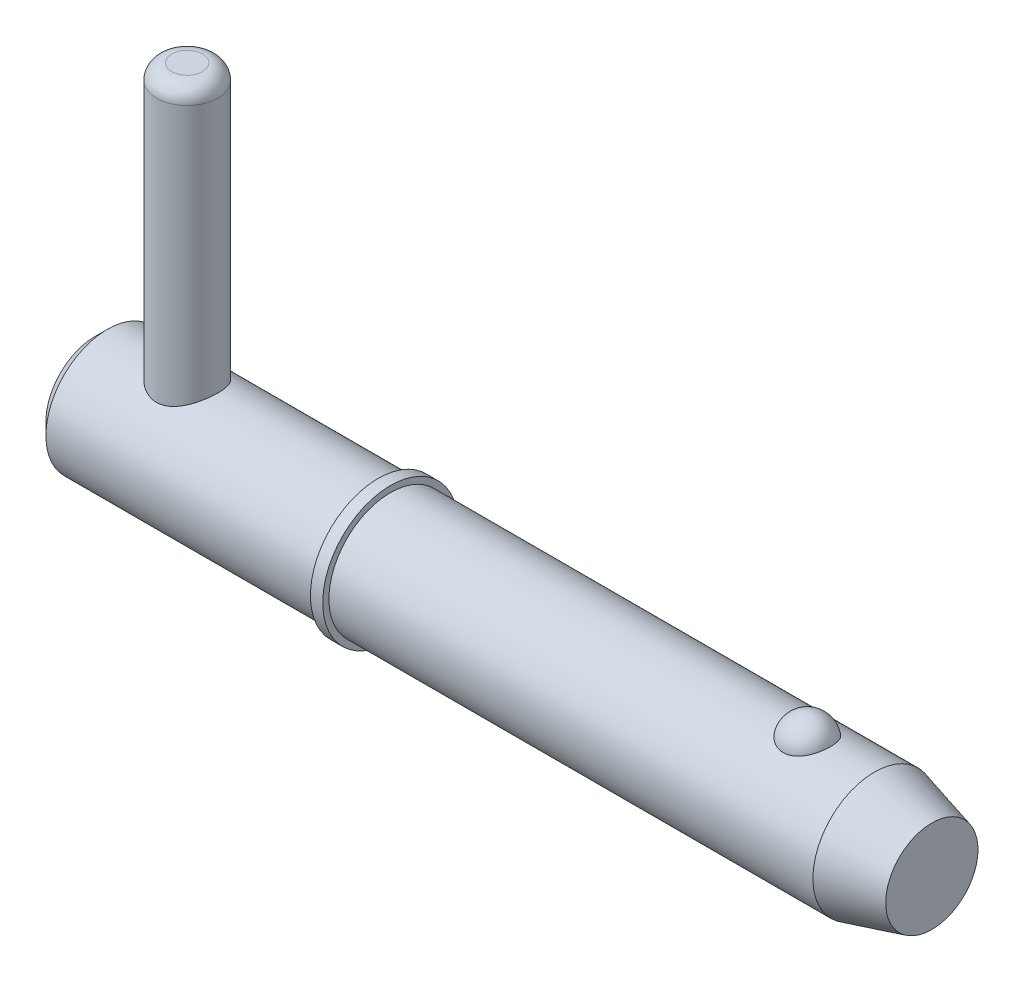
ISO-10303-21;
HEADER;
FILE_DESCRIPTION(('STEP AP214'),'2;1');
FILE_NAME('part.step','',(''),(''),'','','');
FILE_SCHEMA(('AUTOMOTIVE_DESIGN { 1 0 10303 214 1 1 1 1 }'));
ENDSEC;
DATA;
#1=APPLICATION_CONTEXT('core data for automotive mechanical design processes');
#2=APPLICATION_PROTOCOL_DEFINITION('international standard','automotive_design',2000,#1);
#3=PRODUCT_CONTEXT('',#1,'mechanical');
#4=PRODUCT('Part','Part','',(#3));
#5=PRODUCT_RELATED_PRODUCT_CATEGORY('part','',(#4));
#6=PRODUCT_DEFINITION_FORMATION('','',#4);
#7=PRODUCT_DEFINITION_CONTEXT('part definition',#1,'design');
#8=PRODUCT_DEFINITION('design','',#6,#7);
#9=PRODUCT_DEFINITION_SHAPE('','',#8);
#10=(LENGTH_UNIT() NAMED_UNIT(*) SI_UNIT(.MILLI.,.METRE.));
#11=(NAMED_UNIT(*) PLANE_ANGLE_UNIT() SI_UNIT($,.RADIAN.));
#12=(NAMED_UNIT(*) SI_UNIT($,.STERADIAN.) SOLID_ANGLE_UNIT());
#13=UNCERTAINTY_MEASURE_WITH_UNIT(LENGTH_MEASURE(1.E-05),#10,'distance_accuracy_value','');
#14=(GEOMETRIC_REPRESENTATION_CONTEXT(3) GLOBAL_UNCERTAINTY_ASSIGNED_CONTEXT((#13)) GLOBAL_UNIT_ASSIGNED_CONTEXT((#10,
#11,#12)) REPRESENTATION_CONTEXT('',''));
#15=CARTESIAN_POINT('',(0.,0.,0.));
#16=DIRECTION('',(0.,0.,1.));
#17=DIRECTION('',(1.,0.,0.));
#18=AXIS2_PLACEMENT_3D('',#15,#16,#17);
#19=CARTESIAN_POINT('',(5.94,21.43,0.));
#20=DIRECTION('',(0.,-1.,0.));
#21=DIRECTION('',(0.,0.,-1.));
#22=AXIS2_PLACEMENT_3D('',#19,#20,#21);
#23=CYLINDRICAL_SURFACE('',#22,1.98);
#24=CARTESIAN_POINT('',(5.94,-2.98,0.));
#25=DIRECTION('',(0.,1.,0.));
#26=DIRECTION('',(0.,0.,1.));
#27=AXIS2_PLACEMENT_3D('',#24,#25,#26);
#28=CIRCLE('',#27,1.98);
#29=CARTESIAN_POINT('',(5.94,-2.98,1.98));
#30=VERTEX_POINT('',#29);
#31=EDGE_CURVE('P0_E25',#30,#30,#28,.T.);
#32=ORIENTED_EDGE('',*,*,#31,.T.);
#33=EDGE_LOOP('',(#32));
#34=FACE_BOUND('',#33,.T.);
#35=CARTESIAN_POINT('',(5.94,20.44,0.));
#36=DIRECTION('',(0.,1.,0.));
#37=DIRECTION('',(0.,0.,1.));
#38=AXIS2_PLACEMENT_3D('',#35,#36,#37);
#39=CIRCLE('',#38,1.98);
#40=CARTESIAN_POINT('',(5.94,20.44,1.98));
#41=VERTEX_POINT('',#40);
#42=EDGE_CURVE('P0_E29',#41,#41,#39,.F.);
#43=ORIENTED_EDGE('',*,*,#42,.T.);
#44=EDGE_LOOP('',(#43));
#45=FACE_BOUND('',#44,.T.);
#46=ADVANCED_FACE('P0_F14',(#34,#45),#23,.T.);
#47=CARTESIAN_POINT('',(5.94,21.43,0.));
#48=DIRECTION('',(0.,1.,0.));
#49=DIRECTION('',(0.,0.,1.));
#50=AXIS2_PLACEMENT_3D('',#47,#48,#49);
#51=PLANE('',#50);
#52=CARTESIAN_POINT('',(5.94,21.43,0.));
#53=DIRECTION('',(0.,1.,0.));
#54=DIRECTION('',(0.,0.,1.));
#55=AXIS2_PLACEMENT_3D('',#52,#53,#54);
#56=CIRCLE('',#55,0.99);
#57=CARTESIAN_POINT('',(5.94,21.43,0.99));
#58=VERTEX_POINT('',#57);
#59=EDGE_CURVE('P0_E10',#58,#58,#56,.T.);
#60=ORIENTED_EDGE('',*,*,#59,.T.);
#61=EDGE_LOOP('',(#60));
#62=FACE_BOUND('',#61,.T.);
#63=ADVANCED_FACE('P0_F46',(#62),#51,.T.);
#64=CARTESIAN_POINT('',(5.94,-3.97,0.));
#65=DIRECTION('',(0.,1.,0.));
#66=DIRECTION('',(0.,0.,1.));
#67=AXIS2_PLACEMENT_3D('',#64,#65,#66);
#68=PLANE('',#67);
#69=CARTESIAN_POINT('',(5.94,-3.97,0.));
#70=DIRECTION('',(0.,1.,0.));
#71=DIRECTION('',(0.,0.,1.));
#72=AXIS2_PLACEMENT_3D('',#69,#70,#71);
#73=CIRCLE('',#72,0.99);
#74=CARTESIAN_POINT('',(5.94,-3.97,0.99));
#75=VERTEX_POINT('',#74);
#76=EDGE_CURVE('P0_E21',#75,#75,#73,.F.);
#77=ORIENTED_EDGE('',*,*,#76,.T.);
#78=EDGE_LOOP('',(#77));
#79=FACE_BOUND('',#78,.T.);
#80=ADVANCED_FACE('P0_F43',(#79),#68,.F.);
#81=CARTESIAN_POINT('',(5.94,-2.98,0.));
#82=DIRECTION('',(0.,1.,0.));
#83=DIRECTION('',(0.,0.,1.));
#84=AXIS2_PLACEMENT_3D('',#81,#82,#83);
#85=DEGENERATE_TOROIDAL_SURFACE('',#84,0.99,0.99,.T.);
#86=ORIENTED_EDGE('',*,*,#76,.F.);
#87=EDGE_LOOP('',(#86));
#88=FACE_BOUND('',#87,.T.);
#89=ORIENTED_EDGE('',*,*,#31,.F.);
#90=EDGE_LOOP('',(#89));
#91=FACE_BOUND('',#90,.T.);
#92=ADVANCED_FACE('P0_F38',(#88,#91),#85,.T.);
#93=CARTESIAN_POINT('',(5.94,20.44,0.));
#94=DIRECTION('',(0.,1.,0.));
#95=DIRECTION('',(0.,0.,1.));
#96=AXIS2_PLACEMENT_3D('',#93,#94,#95);
#97=DEGENERATE_TOROIDAL_SURFACE('',#96,0.99,0.99,.T.);
#98=ORIENTED_EDGE('',*,*,#42,.F.);
#99=EDGE_LOOP('',(#98));
#100=FACE_BOUND('',#99,.T.);
#101=ORIENTED_EDGE('',*,*,#59,.F.);
#102=EDGE_LOOP('',(#101));
#103=FACE_BOUND('',#102,.T.);
#104=ADVANCED_FACE('P0_F16',(#100,#103),#97,.T.);
#105=CLOSED_SHELL('',(#46,#63,#80,#92,#104));
#106=MANIFOLD_SOLID_BREP('P0_B1',#105);
#107=CARTESIAN_POINT('',(0.,0.,0.));
#108=DIRECTION('',(1.,0.,0.));
#109=DIRECTION('',(0.,0.,-1.));
#110=AXIS2_PLACEMENT_3D('',#107,#108,#109);
#111=CYLINDRICAL_SURFACE('',#110,3.97);
#112=CARTESIAN_POINT('',(50.2759395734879,0.,0.));
#113=DIRECTION('',(1.,0.,0.));
#114=DIRECTION('',(0.,0.,-1.));
#115=AXIS2_PLACEMENT_3D('',#112,#113,#114);
#116=CIRCLE('',#115,3.97);
#117=CARTESIAN_POINT('',(50.2759395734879,0.,-3.97));
#118=VERTEX_POINT('',#117);
#119=EDGE_CURVE('P1_E81',#118,#118,#116,.T.);
#120=ORIENTED_EDGE('',*,*,#119,.F.);
#121=EDGE_LOOP('',(#120));
#122=FACE_BOUND('',#121,.T.);
#123=CARTESIAN_POINT('',(19.05,0.,0.));
#124=DIRECTION('',(1.,0.,0.));
#125=DIRECTION('',(0.,0.,-1.));
#126=AXIS2_PLACEMENT_3D('',#123,#124,#125);
#127=CIRCLE('',#126,3.97);
#128=CARTESIAN_POINT('',(19.05,0.,-3.97));
#129=VERTEX_POINT('',#128);
#130=EDGE_CURVE('P1_E85',#129,#129,#127,.T.);
#131=ORIENTED_EDGE('',*,*,#130,.T.);
#132=EDGE_LOOP('',(#131));
#133=FACE_BOUND('',#132,.T.);
#134=CARTESIAN_POINT('',(45.9451922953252,3.65715365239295,1.54470941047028));
#135=CARTESIAN_POINT('',(45.8652448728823,3.65716001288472,1.54470290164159));
#136=CARTESIAN_POINT('',(45.7851650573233,3.65987074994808,1.53832549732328));
#137=CARTESIAN_POINT('',(45.6272374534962,3.6704221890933,1.51297018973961));
#138=CARTESIAN_POINT('',(45.5493961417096,3.67827646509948,1.49395894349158));
#139=CARTESIAN_POINT('',(45.3984614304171,3.69818848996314,1.44395950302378));
#140=CARTESIAN_POINT('',(45.3253560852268,3.71023513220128,1.41300293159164));
#141=CARTESIAN_POINT('',(45.1855630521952,3.7372183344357,1.34000212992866));
#142=CARTESIAN_POINT('',(45.1188725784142,3.75215363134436,1.29796274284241));
#143=CARTESIAN_POINT('',(44.9914886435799,3.78384968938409,1.20248834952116));
#144=CARTESIAN_POINT('',(44.9310299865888,3.80065129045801,1.14875388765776));
#145=CARTESIAN_POINT('',(44.8196942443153,3.83398532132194,1.03205417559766));
#146=CARTESIAN_POINT('',(44.7688200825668,3.85051766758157,0.969086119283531));
#147=CARTESIAN_POINT('',(44.6756321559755,3.88238608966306,0.832526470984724));
#148=CARTESIAN_POINT('',(44.6337961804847,3.89763698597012,0.758588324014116));
#149=CARTESIAN_POINT('',(44.5625108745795,3.92451063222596,0.604352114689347));
#150=CARTESIAN_POINT('',(44.5330623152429,3.93613315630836,0.524053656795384));
#151=CARTESIAN_POINT('',(44.4868927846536,3.95467606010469,0.358403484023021));
#152=CARTESIAN_POINT('',(44.4703127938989,3.96154426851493,0.273006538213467));
#153=CARTESIAN_POINT('',(44.450756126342,3.96967008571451,0.100408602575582));
#154=CARTESIAN_POINT('',(44.4477789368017,3.97092790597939,0.0132076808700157));
#155=CARTESIAN_POINT('',(44.4554587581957,3.96771794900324,-0.159844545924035));
#156=CARTESIAN_POINT('',(44.4660164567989,3.96329187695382,-0.245701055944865));
#157=CARTESIAN_POINT('',(44.5003800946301,3.94923163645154,-0.414277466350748));
#158=CARTESIAN_POINT('',(44.5241862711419,3.93959737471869,-0.496997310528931));
#159=CARTESIAN_POINT('',(44.5846114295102,3.91607752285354,-0.657113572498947));
#160=CARTESIAN_POINT('',(44.6212495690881,3.90218558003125,-0.734501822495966));
#161=CARTESIAN_POINT('',(44.7065935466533,3.87158287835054,-0.881704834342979));
#162=CARTESIAN_POINT('',(44.7553004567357,3.8548718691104,-0.951518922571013));
#163=CARTESIAN_POINT('',(44.8641161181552,3.82028735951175,-1.08208159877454));
#164=CARTESIAN_POINT('',(44.9242955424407,3.80240713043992,-1.14276958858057));
#165=CARTESIAN_POINT('',(45.054493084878,3.76758161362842,-1.2528243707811));
#166=CARTESIAN_POINT('',(45.1245105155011,3.75063626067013,-1.30219195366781));
#167=CARTESIAN_POINT('',(45.27118160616,3.71998948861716,-1.38729709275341));
#168=CARTESIAN_POINT('',(45.3476813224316,3.70623183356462,-1.42327904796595));
#169=CARTESIAN_POINT('',(45.5062981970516,3.68323188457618,-1.48178996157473));
#170=CARTESIAN_POINT('',(45.5884132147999,3.67398788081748,-1.5043240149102));
#171=CARTESIAN_POINT('',(45.7514810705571,3.6615216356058,-1.53440939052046));
#172=CARTESIAN_POINT('',(45.8322840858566,3.65801951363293,-1.54265826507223));
#173=CARTESIAN_POINT('',(45.9942085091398,3.65657341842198,-1.5460842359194));
#174=CARTESIAN_POINT('',(46.0753298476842,3.65862829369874,-1.54126404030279));
#175=CARTESIAN_POINT('',(46.2328122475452,3.66788969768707,-1.51908474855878));
#176=CARTESIAN_POINT('',(46.3092422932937,3.67492621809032,-1.50213925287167));
#177=CARTESIAN_POINT('',(46.4580412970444,3.69318404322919,-1.45666982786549));
#178=CARTESIAN_POINT('',(46.5304099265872,3.70440568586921,-1.42814496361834));
#179=CARTESIAN_POINT('',(46.6708029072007,3.73012749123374,-1.35956319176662));
#180=CARTESIAN_POINT('',(46.7387000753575,3.74469307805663,-1.31927107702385));
#181=CARTESIAN_POINT('',(46.8668649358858,3.77545272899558,-1.22847440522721));
#182=CARTESIAN_POINT('',(46.9271308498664,3.79164717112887,-1.17796747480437));
#183=CARTESIAN_POINT('',(47.0416346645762,3.82490325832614,-1.06519260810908));
#184=CARTESIAN_POINT('',(47.0954137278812,3.84196735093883,-1.00245914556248));
#185=CARTESIAN_POINT('',(47.1920988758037,3.87439863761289,-0.868715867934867));
#186=CARTESIAN_POINT('',(47.2350030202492,3.88976552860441,-0.797704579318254));
#187=CARTESIAN_POINT('',(47.310266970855,3.91771381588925,-0.646896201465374));
#188=CARTESIAN_POINT('',(47.3422532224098,3.93019255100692,-0.566893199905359));
#189=CARTESIAN_POINT('',(47.3931101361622,3.95043886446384,-0.402255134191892));
#190=CARTESIAN_POINT('',(47.4119807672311,3.95820643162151,-0.317620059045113));
#191=CARTESIAN_POINT('',(47.4362162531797,3.96823733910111,-0.146156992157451));
#192=CARTESIAN_POINT('',(47.4415874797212,3.970503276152,-0.0593300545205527));
#193=CARTESIAN_POINT('',(47.4387309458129,3.96930811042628,0.114057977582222));
#194=CARTESIAN_POINT('',(47.430503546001,3.9658471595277,0.200619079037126));
#195=CARTESIAN_POINT('',(47.4007063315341,3.95358562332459,0.370506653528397));
#196=CARTESIAN_POINT('',(47.3792129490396,3.94481563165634,0.453848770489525));
#197=CARTESIAN_POINT('',(47.3233839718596,3.92284586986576,0.615497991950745));
#198=CARTESIAN_POINT('',(47.2890474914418,3.90964579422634,0.69380474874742));
#199=CARTESIAN_POINT('',(47.2079702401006,3.88006987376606,0.843703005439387));
#200=CARTESIAN_POINT('',(47.1611536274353,3.86367478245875,0.915249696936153));
#201=CARTESIAN_POINT('',(47.0561897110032,3.82949741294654,1.04910810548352));
#202=CARTESIAN_POINT('',(46.9980428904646,3.81171519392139,1.11142021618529));
#203=CARTESIAN_POINT('',(46.8717433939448,3.77673366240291,1.22503948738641));
#204=CARTESIAN_POINT('',(46.8035970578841,3.75953398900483,1.27635357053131));
#205=CARTESIAN_POINT('',(46.6589009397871,3.72770506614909,1.36653336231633));
#206=CARTESIAN_POINT('',(46.582348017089,3.71307678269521,1.40539439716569));
#207=CARTESIAN_POINT('',(46.4257594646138,3.68864287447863,1.46830480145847));
#208=CARTESIAN_POINT('',(46.3459307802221,3.67869017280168,1.49281289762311));
#209=CARTESIAN_POINT('',(46.1829877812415,3.66414535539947,1.52817474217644));
#210=CARTESIAN_POINT('',(46.0998840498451,3.65953723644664,1.53906926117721));
#211=CARTESIAN_POINT('',(45.9927760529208,3.6573894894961,1.54414878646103));
#212=CARTESIAN_POINT('',(45.9689900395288,3.65715175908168,1.54471134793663));
#213=CARTESIAN_POINT('',(45.9451922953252,3.65715365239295,1.54470941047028));
#214=B_SPLINE_CURVE_WITH_KNOTS('',3,(#134,#135,#136,#137,#138,#139,#140,#141,#142,#143,#144,
#145,#146,#147,#148,#149,#150,#151,#152,#153,#154,#155,#156,#157,#158,#159,#160,#161,#162,#163,
#164,#165,#166,#167,#168,#169,#170,#171,#172,#173,#174,#175,#176,#177,#178,#179,#180,#181,#182,
#183,#184,#185,#186,#187,#188,#189,#190,#191,#192,#193,#194,#195,#196,#197,#198,#199,#200,#201,
#202,#203,#204,#205,#206,#207,#208,#209,#210,#211,#212,#213),.UNSPECIFIED.,.T.,.F.,(4,2,2,2,2,2,
2,2,2,2,2,2,2,2,2,2,2,2,2,2,2,2,2,2,2,2,2,2,2,2,2,2,2,2,2,2,2,2,2,4),(0.,0.239777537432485,
0.480190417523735,0.719971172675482,0.959647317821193,1.20639040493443,1.45320863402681,
1.71093679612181,1.96868099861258,2.22921052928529,2.48973023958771,2.74834928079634,
3.00697295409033,3.26598440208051,3.52501886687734,3.78570385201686,4.04637062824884,
4.30201257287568,4.55755760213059,4.80022994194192,5.04285200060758,5.27757006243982,
5.51230707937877,5.75210128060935,5.99195126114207,6.24392810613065,6.49594987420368,
6.75588818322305,7.01582710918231,7.27564332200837,7.53545264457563,7.79377886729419,
8.0521229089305,8.31207418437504,8.57201437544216,8.83179046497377,9.09166393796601,
9.34270057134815,9.59298357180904,9.66435753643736),.UNSPECIFIED.);
#215=CARTESIAN_POINT('',(45.9451922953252,3.65715365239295,1.54470941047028));
#216=VERTEX_POINT('',#215);
#217=EDGE_CURVE('P1_E35',#216,#216,#214,.T.);
#218=ORIENTED_EDGE('',*,*,#217,.T.);
#219=EDGE_LOOP('',(#218));
#220=FACE_BOUND('',#219,.T.);
#221=ADVANCED_FACE('P1_F13',(#122,#133,#220),#111,.T.);
#222=CARTESIAN_POINT('',(0.,0.,0.));
#223=DIRECTION('',(-1.,0.,0.));
#224=DIRECTION('',(0.,0.,1.));
#225=AXIS2_PLACEMENT_3D('',#222,#223,#224);
#226=PLANE('',#225);
#227=CARTESIAN_POINT('',(0.,0.,0.));
#228=DIRECTION('',(1.,0.,0.));
#229=DIRECTION('',(0.,0.,-1.));
#230=AXIS2_PLACEMENT_3D('',#227,#228,#229);
#231=CIRCLE('',#230,3.176);
#232=CARTESIAN_POINT('',(0.,0.,-3.176));
#233=VERTEX_POINT('',#232);
#234=EDGE_CURVE('P1_E9',#233,#233,#231,.T.);
#235=ORIENTED_EDGE('',*,*,#234,.F.);
#236=EDGE_LOOP('',(#235));
#237=FACE_BOUND('',#236,.T.);
#238=ADVANCED_FACE('P1_F15',(#237),#226,.T.);
#239=CARTESIAN_POINT('',(0.793999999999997,0.,0.));
#240=DIRECTION('',(1.,0.,0.));
#241=DIRECTION('',(0.,0.,-1.));
#242=AXIS2_PLACEMENT_3D('',#239,#240,#241);
#243=CONICAL_SURFACE('',#242,3.97,0.78539816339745);
#244=ORIENTED_EDGE('',*,*,#234,.T.);
#245=EDGE_LOOP('',(#244));
#246=FACE_BOUND('',#245,.T.);
#247=CARTESIAN_POINT('',(0.793999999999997,0.,0.));
#248=DIRECTION('',(1.,0.,0.));
#249=DIRECTION('',(0.,0.,-1.));
#250=AXIS2_PLACEMENT_3D('',#247,#248,#249);
#251=CIRCLE('',#250,3.97);
#252=CARTESIAN_POINT('',(0.793999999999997,0.,-3.97));
#253=VERTEX_POINT('',#252);
#254=EDGE_CURVE('P1_E26',#253,#253,#251,.T.);
#255=ORIENTED_EDGE('',*,*,#254,.F.);
#256=EDGE_LOOP('',(#255));
#257=FACE_BOUND('',#256,.T.);
#258=ADVANCED_FACE('P1_F77',(#246,#257),#243,.T.);
#259=CARTESIAN_POINT('',(0.,0.,0.));
#260=DIRECTION('',(1.,0.,0.));
#261=DIRECTION('',(0.,0.,-1.));
#262=AXIS2_PLACEMENT_3D('',#259,#260,#261);
#263=CYLINDRICAL_SURFACE('',#262,3.97);
#264=CARTESIAN_POINT('',(5.94,-3.44100276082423,1.98));
#265=CARTESIAN_POINT('',(5.8367885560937,-3.44101282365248,1.97999171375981));
#266=CARTESIAN_POINT('',(5.73344176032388,-3.44571749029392,1.97187534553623));
#267=CARTESIAN_POINT('',(5.52991905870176,-3.46385873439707,1.93981946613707));
#268=CARTESIAN_POINT('',(5.42975031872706,-3.47731375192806,1.91584653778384));
#269=CARTESIAN_POINT('',(5.23590869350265,-3.51100678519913,1.85336773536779));
#270=CARTESIAN_POINT('',(5.14220446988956,-3.53120882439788,1.81493880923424));
#271=CARTESIAN_POINT('',(4.9625969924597,-3.57606420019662,1.72487335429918));
#272=CARTESIAN_POINT('',(4.87669412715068,-3.6007177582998,1.67323616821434));
#273=CARTESIAN_POINT('',(4.70734412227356,-3.65417020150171,1.55325205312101));
#274=CARTESIAN_POINT('',(4.62467662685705,-3.68314323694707,1.4838818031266));
#275=CARTESIAN_POINT('',(4.47154355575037,-3.74056406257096,1.33252902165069));
#276=CARTESIAN_POINT('',(4.40108404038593,-3.76901158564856,1.25054026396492));
#277=CARTESIAN_POINT('',(4.26974803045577,-3.82445556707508,1.06956584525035));
#278=CARTESIAN_POINT('',(4.20982960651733,-3.8512271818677,0.969809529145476));
#279=CARTESIAN_POINT('',(4.10798077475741,-3.89804342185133,0.760047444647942));
#280=CARTESIAN_POINT('',(4.06603907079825,-3.91809226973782,0.650048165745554));
#281=CARTESIAN_POINT('',(4.00441878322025,-3.94794912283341,0.431181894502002));
#282=CARTESIAN_POINT('',(3.98337329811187,-3.95838209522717,0.322786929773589));
#283=CARTESIAN_POINT('',(3.9596425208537,-3.97016407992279,0.103541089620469));
#284=CARTESIAN_POINT('',(3.95694618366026,-3.97151855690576,-0.00730826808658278));
#285=CARTESIAN_POINT('',(3.9694599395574,-3.96528826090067,-0.218044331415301));
#286=CARTESIAN_POINT('',(3.98314071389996,-3.95846689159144,-0.318049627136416));
#287=CARTESIAN_POINT('',(4.02528522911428,-3.93780347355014,-0.514124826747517));
#288=CARTESIAN_POINT('',(4.05375007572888,-3.92396089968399,-0.61019443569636));
#289=CARTESIAN_POINT('',(4.12484256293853,-3.89028355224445,-0.797351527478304));
#290=CARTESIAN_POINT('',(4.16766142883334,-3.87036821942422,-0.888351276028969));
#291=CARTESIAN_POINT('',(4.26598377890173,-3.82634285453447,-1.06209448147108));
#292=CARTESIAN_POINT('',(4.32149181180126,-3.8022313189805,-1.14483496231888));
#293=CARTESIAN_POINT('',(4.44962332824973,-3.74940011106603,-1.30802500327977));
#294=CARTESIAN_POINT('',(4.52336636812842,-3.72046031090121,-1.38752498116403));
#295=CARTESIAN_POINT('',(4.68287656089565,-3.66269463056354,-1.53354043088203));
#296=CARTESIAN_POINT('',(4.7686527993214,-3.63386885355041,-1.60004599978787));
#297=CARTESIAN_POINT('',(4.9564069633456,-3.57763161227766,-1.72228426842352));
#298=CARTESIAN_POINT('',(5.05906485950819,-3.5504233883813,-1.77707534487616));
#299=CARTESIAN_POINT('',(5.27381412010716,-3.50334038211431,-1.86819784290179));
#300=CARTESIAN_POINT('',(5.38589553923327,-3.48345798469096,-1.90454844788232));
#301=CARTESIAN_POINT('',(5.6069795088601,-3.45548331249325,-1.95481643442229));
#302=CARTESIAN_POINT('',(5.71552407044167,-3.44658268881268,-1.97028113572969));
#303=CARTESIAN_POINT('',(5.93399639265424,-3.43928114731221,-1.98300600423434));
#304=CARTESIAN_POINT('',(6.04392313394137,-3.44087289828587,-1.98027888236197));
#305=CARTESIAN_POINT('',(6.24931618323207,-3.45351901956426,-1.95811780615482));
#306=CARTESIAN_POINT('',(6.34505668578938,-3.46352725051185,-1.94052989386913));
#307=CARTESIAN_POINT('',(6.53204702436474,-3.49033612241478,-1.89188242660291));
#308=CARTESIAN_POINT('',(6.62329540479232,-3.50713894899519,-1.86081853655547));
#309=CARTESIAN_POINT('',(6.80352105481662,-3.54655680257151,-1.78458666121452));
#310=CARTESIAN_POINT('',(6.89219712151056,-3.56940508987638,-1.73883178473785));
#311=CARTESIAN_POINT('',(7.06112449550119,-3.61813012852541,-1.63502913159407));
#312=CARTESIAN_POINT('',(7.14137144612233,-3.6440084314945,-1.57697504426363));
#313=CARTESIAN_POINT('',(7.30168083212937,-3.69977514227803,-1.44171920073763));
#314=CARTESIAN_POINT('',(7.38046039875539,-3.7297597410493,-1.36302972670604));
#315=CARTESIAN_POINT('',(7.52409649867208,-3.78754991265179,-1.19307190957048));
#316=CARTESIAN_POINT('',(7.58894840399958,-3.81535475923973,-1.10179940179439));
#317=CARTESIAN_POINT('',(7.70430122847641,-3.86658972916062,-0.906019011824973));
#318=CARTESIAN_POINT('',(7.75438714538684,-3.88988795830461,-0.801229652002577));
#319=CARTESIAN_POINT('',(7.83572184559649,-3.92848199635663,-0.583216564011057));
#320=CARTESIAN_POINT('',(7.86698708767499,-3.94378479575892,-0.470000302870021));
#321=CARTESIAN_POINT('',(7.90711051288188,-3.96355307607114,-0.249525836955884));
#322=CARTESIAN_POINT('',(7.91775648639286,-3.96888171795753,-0.142669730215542));
#323=CARTESIAN_POINT('',(7.92160247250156,-3.97079858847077,0.0714191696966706));
#324=CARTESIAN_POINT('',(7.91480852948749,-3.96738984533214,0.178651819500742));
#325=CARTESIAN_POINT('',(7.88515479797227,-3.9527181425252,0.383072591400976));
#326=CARTESIAN_POINT('',(7.8633739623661,-3.94198303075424,0.480459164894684));
#327=CARTESIAN_POINT('',(7.80581513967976,-3.91422178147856,0.670038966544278));
#328=CARTESIAN_POINT('',(7.77003513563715,-3.89719473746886,0.762231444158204));
#329=CARTESIAN_POINT('',(7.68389191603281,-3.85747818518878,0.943248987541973));
#330=CARTESIAN_POINT('',(7.63296879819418,-3.83457704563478,1.03175978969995));
#331=CARTESIAN_POINT('',(7.51869140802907,-3.7855122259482,1.19934744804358));
#332=CARTESIAN_POINT('',(7.45533142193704,-3.75934704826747,1.2784199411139));
#333=CARTESIAN_POINT('',(7.31068939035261,-3.70329841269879,1.433144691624));
#334=CARTESIAN_POINT('',(7.22825362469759,-3.67330340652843,1.50768183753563));
#335=CARTESIAN_POINT('',(7.05162367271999,-3.61514025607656,1.64226879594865));
#336=CARTESIAN_POINT('',(6.95741928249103,-3.58697372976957,1.70230590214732));
#337=CARTESIAN_POINT('',(6.75590859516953,-3.53504049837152,1.80775364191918));
#338=CARTESIAN_POINT('',(6.64828786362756,-3.51143624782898,1.85265616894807));
#339=CARTESIAN_POINT('',(6.48137774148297,-3.48289659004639,1.90544537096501));
#340=CARTESIAN_POINT('',(6.42488151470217,-3.4745323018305,1.9206071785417));
#341=CARTESIAN_POINT('',(6.31046920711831,-3.4604244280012,1.94591259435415));
#342=CARTESIAN_POINT('',(6.25255415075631,-3.45467900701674,1.95605971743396));
#343=CARTESIAN_POINT('',(6.1521444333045,-3.44728060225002,1.96905939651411));
#344=CARTESIAN_POINT('',(6.10985721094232,-3.44493297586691,1.97315742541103));
#345=CARTESIAN_POINT('',(6.02505433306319,-3.44179192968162,1.97862952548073));
#346=CARTESIAN_POINT('',(5.98253866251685,-3.44099861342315,1.98000341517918));
#347=CARTESIAN_POINT('',(5.94,-3.44100276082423,1.98));
#348=B_SPLINE_CURVE_WITH_KNOTS('',3,(#264,#265,#266,#267,#268,#269,#270,#271,#272,#273,#274,
#275,#276,#277,#278,#279,#280,#281,#282,#283,#284,#285,#286,#287,#288,#289,#290,#291,#292,#293,
#294,#295,#296,#297,#298,#299,#300,#301,#302,#303,#304,#305,#306,#307,#308,#309,#310,#311,#312,
#313,#314,#315,#316,#317,#318,#319,#320,#321,#322,#323,#324,#325,#326,#327,#328,#329,#330,#331,
#332,#333,#334,#335,#336,#337,#338,#339,#340,#341,#342,#343,#344,#345,#346,#347),.UNSPECIFIED.,
.T.,.F.,(4,2,2,2,2,2,2,2,2,2,2,2,2,2,2,2,2,2,2,2,2,2,2,2,2,2,2,2,2,2,2,2,2,2,2,2,2,2,2,2,2,4),
(0.,0.309462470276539,0.619579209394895,0.928068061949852,1.23657226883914,1.57038619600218,
1.90436536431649,2.26071614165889,2.61684266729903,2.94773555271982,3.27842924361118,
3.58050679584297,3.88260694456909,4.18890317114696,4.49530936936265,4.83057163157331,
5.1660884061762,5.52272472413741,5.87898927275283,6.20706708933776,6.53491569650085,
6.82716910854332,7.11951660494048,7.42541184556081,7.73146442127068,8.07586334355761,
8.42037652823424,8.77380887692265,9.12693169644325,9.44775848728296,9.76847409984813,
10.0682302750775,10.3680296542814,10.6806938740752,10.9935020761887,11.3373031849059,
11.6814044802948,12.0361164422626,12.2131519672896,12.3900632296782,12.5175998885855,
12.6451450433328),.UNSPECIFIED.);
#349=CARTESIAN_POINT('',(5.94,-3.44100276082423,1.98));
#350=VERTEX_POINT('',#349);
#351=EDGE_CURVE('P1_E17',#350,#350,#348,.T.);
#352=ORIENTED_EDGE('',*,*,#351,.F.);
#353=EDGE_LOOP('',(#352));
#354=FACE_BOUND('',#353,.T.);
#355=CARTESIAN_POINT('',(5.94,3.44100276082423,1.98));
#356=CARTESIAN_POINT('',(6.0432114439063,3.44101282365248,1.97999171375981));
#357=CARTESIAN_POINT('',(6.14655823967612,3.44571749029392,1.97187534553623));
#358=CARTESIAN_POINT('',(6.35008094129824,3.46385873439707,1.93981946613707));
#359=CARTESIAN_POINT('',(6.45024968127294,3.47731375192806,1.91584653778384));
#360=CARTESIAN_POINT('',(6.64409130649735,3.51100678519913,1.85336773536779));
#361=CARTESIAN_POINT('',(6.73779553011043,3.53120882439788,1.81493880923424));
#362=CARTESIAN_POINT('',(6.91740300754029,3.57606420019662,1.72487335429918));
#363=CARTESIAN_POINT('',(7.00330587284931,3.6007177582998,1.67323616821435));
#364=CARTESIAN_POINT('',(7.17265587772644,3.65417020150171,1.55325205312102));
#365=CARTESIAN_POINT('',(7.25532337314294,3.68314323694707,1.4838818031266));
#366=CARTESIAN_POINT('',(7.40845644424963,3.74056406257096,1.3325290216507));
#367=CARTESIAN_POINT('',(7.47891595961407,3.76901158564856,1.25054026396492));
#368=CARTESIAN_POINT('',(7.61025196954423,3.82445556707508,1.06956584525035));
#369=CARTESIAN_POINT('',(7.67017039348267,3.8512271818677,0.969809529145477));
#370=CARTESIAN_POINT('',(7.77201922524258,3.89804342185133,0.760047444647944));
#371=CARTESIAN_POINT('',(7.81396092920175,3.91809226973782,0.650048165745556));
#372=CARTESIAN_POINT('',(7.87558121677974,3.94794912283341,0.431181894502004));
#373=CARTESIAN_POINT('',(7.89662670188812,3.95838209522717,0.322786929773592));
#374=CARTESIAN_POINT('',(7.9203574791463,3.97016407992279,0.103541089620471));
#375=CARTESIAN_POINT('',(7.92305381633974,3.97151855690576,-0.00730826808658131));
#376=CARTESIAN_POINT('',(7.9105400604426,3.96528826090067,-0.2180443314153));
#377=CARTESIAN_POINT('',(7.89685928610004,3.95846689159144,-0.318049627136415));
#378=CARTESIAN_POINT('',(7.85471477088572,3.93780347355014,-0.514124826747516));
#379=CARTESIAN_POINT('',(7.82624992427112,3.92396089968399,-0.61019443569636));
#380=CARTESIAN_POINT('',(7.75515743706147,3.89028355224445,-0.797351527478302));
#381=CARTESIAN_POINT('',(7.71233857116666,3.87036821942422,-0.888351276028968));
#382=CARTESIAN_POINT('',(7.61401622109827,3.82634285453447,-1.06209448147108));
#383=CARTESIAN_POINT('',(7.55850818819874,3.8022313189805,-1.14483496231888));
#384=CARTESIAN_POINT('',(7.43037667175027,3.74940011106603,-1.30802500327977));
#385=CARTESIAN_POINT('',(7.35663363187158,3.72046031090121,-1.38752498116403));
#386=CARTESIAN_POINT('',(7.19712343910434,3.66269463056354,-1.53354043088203));
#387=CARTESIAN_POINT('',(7.1113472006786,3.63386885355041,-1.60004599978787));
#388=CARTESIAN_POINT('',(6.9235930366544,3.57763161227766,-1.72228426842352));
#389=CARTESIAN_POINT('',(6.82093514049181,3.5504233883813,-1.77707534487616));
#390=CARTESIAN_POINT('',(6.60618587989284,3.50334038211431,-1.86819784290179));
#391=CARTESIAN_POINT('',(6.49410446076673,3.48345798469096,-1.90454844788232));
#392=CARTESIAN_POINT('',(6.2730204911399,3.45548331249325,-1.95481643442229));
#393=CARTESIAN_POINT('',(6.16447592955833,3.44658268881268,-1.97028113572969));
#394=CARTESIAN_POINT('',(5.94600360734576,3.43928114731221,-1.98300600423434));
#395=CARTESIAN_POINT('',(5.83607686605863,3.44087289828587,-1.98027888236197));
#396=CARTESIAN_POINT('',(5.63068381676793,3.45351901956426,-1.95811780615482));
#397=CARTESIAN_POINT('',(5.53494331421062,3.46352725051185,-1.94052989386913));
#398=CARTESIAN_POINT('',(5.34795297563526,3.49033612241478,-1.89188242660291));
#399=CARTESIAN_POINT('',(5.25670459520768,3.50713894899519,-1.86081853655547));
#400=CARTESIAN_POINT('',(5.07647894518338,3.54655680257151,-1.78458666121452));
#401=CARTESIAN_POINT('',(4.98780287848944,3.56940508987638,-1.73883178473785));
#402=CARTESIAN_POINT('',(4.81887550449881,3.61813012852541,-1.63502913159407));
#403=CARTESIAN_POINT('',(4.73862855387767,3.6440084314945,-1.57697504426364));
#404=CARTESIAN_POINT('',(4.57831916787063,3.69977514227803,-1.44171920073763));
#405=CARTESIAN_POINT('',(4.49953960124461,3.7297597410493,-1.36302972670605));
#406=CARTESIAN_POINT('',(4.35590350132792,3.78754991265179,-1.19307190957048));
#407=CARTESIAN_POINT('',(4.29105159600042,3.81535475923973,-1.10179940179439));
#408=CARTESIAN_POINT('',(4.17569877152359,3.86658972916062,-0.906019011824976));
#409=CARTESIAN_POINT('',(4.12561285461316,3.88988795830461,-0.80122965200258));
#410=CARTESIAN_POINT('',(4.04427815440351,3.92848199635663,-0.58321656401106));
#411=CARTESIAN_POINT('',(4.01301291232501,3.94378479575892,-0.470000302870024));
#412=CARTESIAN_POINT('',(3.97288948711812,3.96355307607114,-0.249525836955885));
#413=CARTESIAN_POINT('',(3.96224351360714,3.96888171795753,-0.142669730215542));
#414=CARTESIAN_POINT('',(3.95839752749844,3.97079858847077,0.0714191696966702));
#415=CARTESIAN_POINT('',(3.96519147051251,3.96738984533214,0.178651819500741));
#416=CARTESIAN_POINT('',(3.99484520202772,3.9527181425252,0.383072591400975));
#417=CARTESIAN_POINT('',(4.01662603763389,3.94198303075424,0.480459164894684));
#418=CARTESIAN_POINT('',(4.07418486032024,3.91422178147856,0.670038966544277));
#419=CARTESIAN_POINT('',(4.10996486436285,3.89719473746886,0.762231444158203));
#420=CARTESIAN_POINT('',(4.19610808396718,3.85747818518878,0.943248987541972));
#421=CARTESIAN_POINT('',(4.24703120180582,3.83457704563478,1.03175978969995));
#422=CARTESIAN_POINT('',(4.36130859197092,3.7855122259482,1.19934744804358));
#423=CARTESIAN_POINT('',(4.42466857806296,3.75934704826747,1.2784199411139));
#424=CARTESIAN_POINT('',(4.56931060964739,3.70329841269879,1.433144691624));
#425=CARTESIAN_POINT('',(4.65174637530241,3.67330340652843,1.50768183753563));
#426=CARTESIAN_POINT('',(4.82837632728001,3.61514025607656,1.64226879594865));
#427=CARTESIAN_POINT('',(4.92258071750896,3.58697372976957,1.70230590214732));
#428=CARTESIAN_POINT('',(5.12409140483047,3.53504049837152,1.80775364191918));
#429=CARTESIAN_POINT('',(5.23171213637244,3.51143624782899,1.85265616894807));
#430=CARTESIAN_POINT('',(5.39862225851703,3.48289659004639,1.90544537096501));
#431=CARTESIAN_POINT('',(5.45511848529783,3.4745323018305,1.9206071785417));
#432=CARTESIAN_POINT('',(5.56953079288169,3.4604244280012,1.94591259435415));
#433=CARTESIAN_POINT('',(5.62744584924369,3.45467900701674,1.95605971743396));
#434=CARTESIAN_POINT('',(5.7278555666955,3.44728060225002,1.9690593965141));
#435=CARTESIAN_POINT('',(5.77014278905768,3.44493297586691,1.97315742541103));
#436=CARTESIAN_POINT('',(5.85494566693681,3.44179192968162,1.97862952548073));
#437=CARTESIAN_POINT('',(5.89746133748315,3.44099861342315,1.98000341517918));
#438=CARTESIAN_POINT('',(5.94,3.44100276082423,1.98));
#439=B_SPLINE_CURVE_WITH_KNOTS('',3,(#355,#356,#357,#358,#359,#360,#361,#362,#363,#364,#365,
#366,#367,#368,#369,#370,#371,#372,#373,#374,#375,#376,#377,#378,#379,#380,#381,#382,#383,#384,
#385,#386,#387,#388,#389,#390,#391,#392,#393,#394,#395,#396,#397,#398,#399,#400,#401,#402,#403,
#404,#405,#406,#407,#408,#409,#410,#411,#412,#413,#414,#415,#416,#417,#418,#419,#420,#421,#422,
#423,#424,#425,#426,#427,#428,#429,#430,#431,#432,#433,#434,#435,#436,#437,#438),.UNSPECIFIED.,
.T.,.F.,(4,2,2,2,2,2,2,2,2,2,2,2,2,2,2,2,2,2,2,2,2,2,2,2,2,2,2,2,2,2,2,2,2,2,2,2,2,2,2,2,2,4),
(0.,0.309462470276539,0.619579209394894,0.928068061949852,1.23657226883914,1.57038619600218,
1.90436536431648,2.26071614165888,2.61684266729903,2.94773555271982,3.27842924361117,
3.58050679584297,3.88260694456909,4.18890317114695,4.49530936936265,4.83057163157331,
5.1660884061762,5.5227247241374,5.87898927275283,6.20706708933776,6.53491569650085,
6.82716910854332,7.11951660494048,7.42541184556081,7.73146442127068,8.07586334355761,
8.42037652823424,8.77380887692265,9.12693169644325,9.44775848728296,9.76847409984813,
10.0682302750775,10.3680296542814,10.6806938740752,10.9935020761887,11.3373031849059,
11.6814044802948,12.0361164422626,12.2131519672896,12.3900632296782,12.5175998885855,
12.6451450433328),.UNSPECIFIED.);
#440=CARTESIAN_POINT('',(5.94,3.44100276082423,1.98));
#441=VERTEX_POINT('',#440);
#442=EDGE_CURVE('P1_E43',#441,#441,#439,.T.);
#443=ORIENTED_EDGE('',*,*,#442,.F.);
#444=EDGE_LOOP('',(#443));
#445=FACE_BOUND('',#444,.T.);
#446=ORIENTED_EDGE('',*,*,#254,.T.);
#447=EDGE_LOOP('',(#446));
#448=FACE_BOUND('',#447,.T.);
#449=CARTESIAN_POINT('',(18.256,0.,0.));
#450=DIRECTION('',(1.,0.,0.));
#451=DIRECTION('',(0.,0.,-1.));
#452=AXIS2_PLACEMENT_3D('',#449,#450,#451);
#453=CIRCLE('',#452,3.97);
#454=CARTESIAN_POINT('',(18.256,0.,-3.97));
#455=VERTEX_POINT('',#454);
#456=EDGE_CURVE('P1_E31',#455,#455,#453,.T.);
#457=ORIENTED_EDGE('',*,*,#456,.F.);
#458=EDGE_LOOP('',(#457));
#459=FACE_BOUND('',#458,.T.);
#460=ADVANCED_FACE('P1_F103',(#354,#445,#448,#459),#263,.T.);
#461=CARTESIAN_POINT('',(18.256,3.97,0.));
#462=DIRECTION('',(-1.,0.,0.));
#463=DIRECTION('',(0.,0.,1.));
#464=AXIS2_PLACEMENT_3D('',#461,#462,#463);
#465=PLANE('',#464);
#466=ORIENTED_EDGE('',*,*,#456,.T.);
#467=EDGE_LOOP('',(#466));
#468=FACE_BOUND('',#467,.T.);
#469=CARTESIAN_POINT('',(18.256,0.,0.));
#470=DIRECTION('',(1.,0.,0.));
#471=DIRECTION('',(0.,0.,-1.));
#472=AXIS2_PLACEMENT_3D('',#469,#470,#471);
#473=CIRCLE('',#472,4.367);
#474=CARTESIAN_POINT('',(18.256,0.,-4.367));
#475=VERTEX_POINT('',#474);
#476=EDGE_CURVE('P1_E91',#475,#475,#473,.T.);
#477=ORIENTED_EDGE('',*,*,#476,.F.);
#478=EDGE_LOOP('',(#477));
#479=FACE_BOUND('',#478,.T.);
#480=ADVANCED_FACE('P1_F100',(#468,#479),#465,.T.);
#481=CARTESIAN_POINT('',(0.,0.,0.));
#482=DIRECTION('',(1.,0.,0.));
#483=DIRECTION('',(0.,0.,-1.));
#484=AXIS2_PLACEMENT_3D('',#481,#482,#483);
#485=CYLINDRICAL_SURFACE('',#484,4.367);
#486=ORIENTED_EDGE('',*,*,#476,.T.);
#487=EDGE_LOOP('',(#486));
#488=FACE_BOUND('',#487,.T.);
#489=CARTESIAN_POINT('',(19.05,0.,0.));
#490=DIRECTION('',(1.,0.,0.));
#491=DIRECTION('',(0.,0.,-1.));
#492=AXIS2_PLACEMENT_3D('',#489,#490,#491);
#493=CIRCLE('',#492,4.367);
#494=CARTESIAN_POINT('',(19.05,0.,-4.367));
#495=VERTEX_POINT('',#494);
#496=EDGE_CURVE('P1_E88',#495,#495,#493,.T.);
#497=ORIENTED_EDGE('',*,*,#496,.F.);
#498=EDGE_LOOP('',(#497));
#499=FACE_BOUND('',#498,.T.);
#500=ADVANCED_FACE('P1_F68',(#488,#499),#485,.T.);
#501=CARTESIAN_POINT('',(19.05,4.367,0.));
#502=DIRECTION('',(1.,0.,0.));
#503=DIRECTION('',(0.,0.,-1.));
#504=AXIS2_PLACEMENT_3D('',#501,#502,#503);
#505=PLANE('',#504);
#506=ORIENTED_EDGE('',*,*,#496,.T.);
#507=EDGE_LOOP('',(#506));
#508=FACE_BOUND('',#507,.T.);
#509=ORIENTED_EDGE('',*,*,#130,.F.);
#510=EDGE_LOOP('',(#509));
#511=FACE_BOUND('',#510,.T.);
#512=ADVANCED_FACE('P1_F62',(#508,#511),#505,.T.);
#513=CARTESIAN_POINT('',(53.98,0.,0.));
#514=DIRECTION('',(-1.,0.,0.));
#515=DIRECTION('',(0.,0.,1.));
#516=AXIS2_PLACEMENT_3D('',#513,#514,#515);
#517=CONICAL_SURFACE('',#516,2.97750000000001,0.26179938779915);
#518=ORIENTED_EDGE('',*,*,#119,.T.);
#519=EDGE_LOOP('',(#518));
#520=FACE_BOUND('',#519,.T.);
#521=CARTESIAN_POINT('',(53.98,0.,0.));
#522=DIRECTION('',(1.,0.,0.));
#523=DIRECTION('',(0.,0.,-1.));
#524=AXIS2_PLACEMENT_3D('',#521,#522,#523);
#525=CIRCLE('',#524,2.97750000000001);
#526=CARTESIAN_POINT('',(53.98,0.,-2.97750000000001));
#527=VERTEX_POINT('',#526);
#528=EDGE_CURVE('P1_E42',#527,#527,#525,.T.);
#529=ORIENTED_EDGE('',*,*,#528,.F.);
#530=EDGE_LOOP('',(#529));
#531=FACE_BOUND('',#530,.T.);
#532=ADVANCED_FACE('P1_F59',(#520,#531),#517,.T.);
#533=CARTESIAN_POINT('',(53.98,2.97750000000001,0.));
#534=DIRECTION('',(1.,0.,0.));
#535=DIRECTION('',(0.,0.,-1.));
#536=AXIS2_PLACEMENT_3D('',#533,#534,#535);
#537=PLANE('',#536);
#538=ORIENTED_EDGE('',*,*,#528,.T.);
#539=EDGE_LOOP('',(#538));
#540=FACE_BOUND('',#539,.T.);
#541=ADVANCED_FACE('P1_F55',(#540),#537,.T.);
#542=CARTESIAN_POINT('',(45.9451922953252,3.573,0.));
#543=DIRECTION('',(-1.,0.,0.));
#544=DIRECTION('',(0.,-1.,0.));
#545=AXIS2_PLACEMENT_3D('',#542,#543,#544);
#546=SPHERICAL_SURFACE('',#545,1.54699999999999);
#547=ORIENTED_EDGE('',*,*,#217,.F.);
#548=EDGE_LOOP('',(#547));
#549=FACE_BOUND('',#548,.T.);
#550=ADVANCED_FACE('P1_F50',(#549),#546,.T.);
#551=CARTESIAN_POINT('',(5.94,-4.367,0.));
#552=DIRECTION('',(0.,1.,0.));
#553=DIRECTION('',(0.,0.,1.));
#554=AXIS2_PLACEMENT_3D('',#551,#552,#553);
#555=CYLINDRICAL_SURFACE('',#554,1.98);
#556=ORIENTED_EDGE('',*,*,#351,.T.);
#557=EDGE_LOOP('',(#556));
#558=FACE_BOUND('',#557,.T.);
#559=ORIENTED_EDGE('',*,*,#442,.T.);
#560=EDGE_LOOP('',(#559));
#561=FACE_BOUND('',#560,.T.);
#562=ADVANCED_FACE('P1_F54',(#558,#561),#555,.F.);
#563=CLOSED_SHELL('',(#221,#238,#258,#460,#480,#500,#512,#532,#541,#550,#562));
#564=MANIFOLD_SOLID_BREP('P1_B1',#563);
#565=ADVANCED_BREP_SHAPE_REPRESENTATION('',(#18,#106,#564),#14);
#566=SHAPE_DEFINITION_REPRESENTATION(#9,#565);
ENDSEC;
END-ISO-10303-21;
